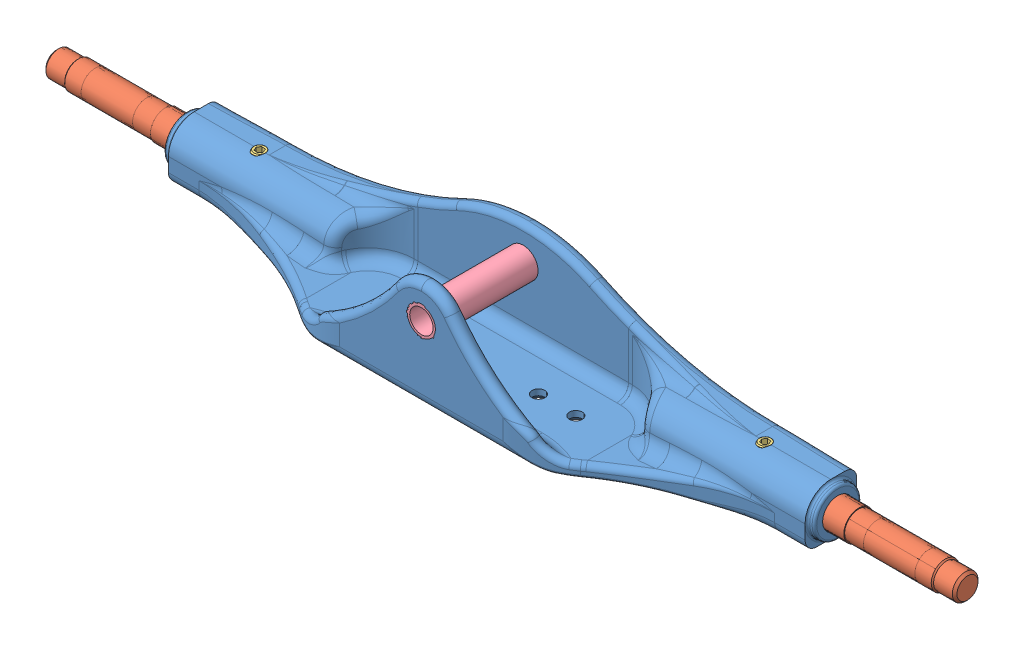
SolidWorks assembly Axle Assembly_&.SLDASM, configuration Default (file format 5000). Lengths in mm.
Overall size (389.22 51.41 56.1).
6 component instances, 4 part files, 10 mates.
Components (placement in the parent):
- Axle_&-1: Axle_&.SLDPRT [Default] at origin size (278 51.41 56.1)
- Axle Shaft_&-1: Axle Shaft_&.SLDPRT [Default] at (70.9099 11 11.1) x (1 0 0) z (0 -0.729631 -0.683841) size (123.5 12.7 12.7)
- Axle Shaft_&-2: Axle Shaft_&.SLDPRT [Default] at (-71.309 11 11.1) x (-1 0 0) z (0 0.77125 -0.636533) size (123.5 12.7 12.7)
- Socket Set Screw Cup Point_AM_&-1: Socket Set Screw Cup Point_AM_&.SLDPRT [B18.3.6M - M6 x 1.0 x 6 Hex Socket Type I Cup Pt. SS --N] at (-108 22 11.1) x (0 -1 0) z (0.389991 0 0.920819) size (6 6 6)
- Socket Set Screw Cup Point_AM_&-2: Socket Set Screw Cup Point_AM_&.SLDPRT [B18.3.6M - M6 x 1.0 x 6 Hex Socket Type I Cup Pt. SS --N] at (108 22 11.1) x (0 -1 0) z (0.389991 0 0.920819) size (6 6 6)
- King Pin Sleeve_&-1: King Pin Sleeve_&.SLDPRT [Default] at (0 32 24.6) x (0 0 1) z (-1 0 0) size (50.8 12.7 12.7)
Mates (geometry in assembly coordinates):
- Concentric7: concentric anti-aligned: cylinder of Axle_&-1 through (139 11 11.1) axis (1 0 0) radius 6.5; cylinder of Axle Shaft_&-1 through (194.4099 11 11.1) axis (-1 0 0) radius 6.35
- Coincident4: coincident: cone of Axle_&-1 through (72 11 11.1) axis (-1 0 0); circle of Axle Shaft_&-1
- Concentric9: concentric anti-aligned: cylinder of Axle_&-1 through (-139 11 11.1) axis (-1 0 0) radius 6.5; cylinder of Axle Shaft_&-2 through (-194.809 11 11.1) axis (1 0 0) radius 6.35
- Coincident5: coincident: cone of Axle_&-1 through (-72 11 11.1) axis (1 0 0); circle of Axle Shaft_&-2
- Concentric10: concentric aligned: cylinder of Axle_&-1 through (-108 22 11.1) axis (0 1 0) radius 2.5; cylinder of Socket Set Screw Cup Point_AM_&-1 through (-108 34.7 11.1) axis (0 1 0) radius 3
- Coincident6: coincident aligned: plane of Axle_&-1 through (-136 22 11) normal (0 1 0); plane of Socket Set Screw Cup Point_AM_&-1 through (-108 22 11.1) normal (0 1 0)
- Concentric11: concentric aligned: cylinder of Axle_&-1 through (108 22 11.1) axis (0 1 0) radius 2.5; cylinder of Socket Set Screw Cup Point_AM_&-2 through (108 34.7 11.1) axis (0 1 0) radius 3
- Coincident7: coincident aligned: plane of Axle_&-1 through (136 22 11) normal (0 1 0); plane of Socket Set Screw Cup Point_AM_&-2 through (108 22 11.1) normal (0 1 0)
- Concentric12: concentric aligned: circle of Axle_&-1; circle of King Pin Sleeve_&-1
- Coincident8: coincident aligned: plane of Axle_&-1 through (0 11 50) normal (0 0 1); plane of King Pin Sleeve_&-1 through (0 32 50) normal (0 0 1)
